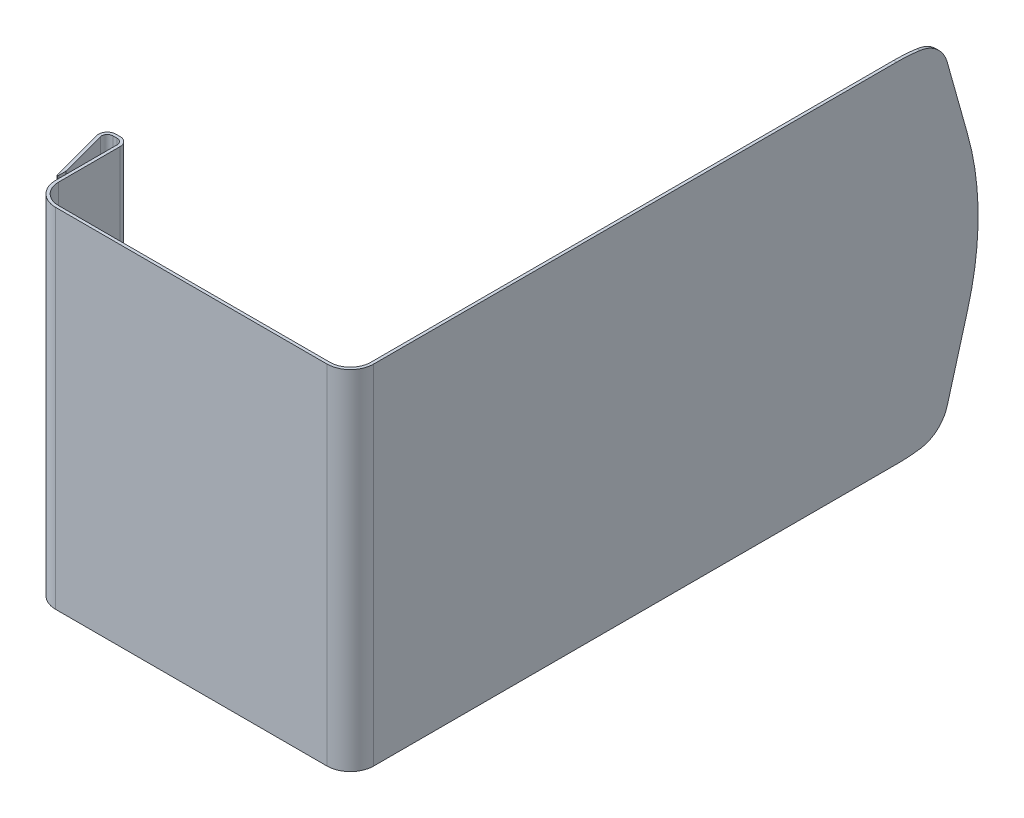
ISO-10303-21;
HEADER;
FILE_DESCRIPTION(('STEP AP214'),'2;1');
FILE_NAME('part.step','',(''),(''),'','','');
FILE_SCHEMA(('AUTOMOTIVE_DESIGN { 1 0 10303 214 1 1 1 1 }'));
ENDSEC;
DATA;
#1=APPLICATION_CONTEXT('core data for automotive mechanical design processes');
#2=APPLICATION_PROTOCOL_DEFINITION('international standard','automotive_design',2000,#1);
#3=PRODUCT_CONTEXT('',#1,'mechanical');
#4=PRODUCT('Part','Part','',(#3));
#5=PRODUCT_RELATED_PRODUCT_CATEGORY('part','',(#4));
#6=PRODUCT_DEFINITION_FORMATION('','',#4);
#7=PRODUCT_DEFINITION_CONTEXT('part definition',#1,'design');
#8=PRODUCT_DEFINITION('design','',#6,#7);
#9=PRODUCT_DEFINITION_SHAPE('','',#8);
#10=(LENGTH_UNIT() NAMED_UNIT(*) SI_UNIT(.MILLI.,.METRE.));
#11=(NAMED_UNIT(*) PLANE_ANGLE_UNIT() SI_UNIT($,.RADIAN.));
#12=(NAMED_UNIT(*) SI_UNIT($,.STERADIAN.) SOLID_ANGLE_UNIT());
#13=UNCERTAINTY_MEASURE_WITH_UNIT(LENGTH_MEASURE(1.E-05),#10,'distance_accuracy_value','');
#14=(GEOMETRIC_REPRESENTATION_CONTEXT(3) GLOBAL_UNCERTAINTY_ASSIGNED_CONTEXT((#13)) GLOBAL_UNIT_ASSIGNED_CONTEXT((#10,
#11,#12)) REPRESENTATION_CONTEXT('',''));
#15=CARTESIAN_POINT('',(0.,0.,0.));
#16=DIRECTION('',(0.,0.,1.));
#17=DIRECTION('',(1.,0.,0.));
#18=AXIS2_PLACEMENT_3D('',#15,#16,#17);
#19=CARTESIAN_POINT('',(3.175,186.063255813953,277.));
#20=DIRECTION('',(0.,-1.,0.));
#21=DIRECTION('',(0.,0.,-1.));
#22=AXIS2_PLACEMENT_3D('',#19,#20,#21);
#23=PLANE('',#22);
#24=DIRECTION('',(0.,0.,1.));
#25=VECTOR('',#24,1.);
#26=CARTESIAN_POINT('',(0.,186.063255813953,277.));
#27=LINE('',#26,#25);
#28=CARTESIAN_POINT('',(0.,186.063255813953,-277.));
#29=VERTEX_POINT('',#28);
#30=CARTESIAN_POINT('',(0.,186.063255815,282.));
#31=VERTEX_POINT('',#30);
#32=EDGE_CURVE('E868',#29,#31,#27,.T.);
#33=ORIENTED_EDGE('',*,*,#32,.T.);
#34=CARTESIAN_POINT('',(-21.825,186.063255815,282.));
#35=DIRECTION('',(0.,-1.,0.));
#36=DIRECTION('',(0.,0.,-1.));
#37=AXIS2_PLACEMENT_3D('',#34,#35,#36);
#38=CIRCLE('',#37,21.825);
#39=CARTESIAN_POINT('',(-21.825,186.063255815,303.825));
#40=VERTEX_POINT('',#39);
#41=EDGE_CURVE('E664',#31,#40,#38,.T.);
#42=ORIENTED_EDGE('',*,*,#41,.T.);
#43=DIRECTION('',(-1.,0.,0.));
#44=VECTOR('',#43,1.);
#45=CARTESIAN_POINT('',(-21.825,186.063255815,303.825));
#46=LINE('',#45,#44);
#47=CARTESIAN_POINT('',(-311.825,186.063255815,303.825));
#48=VERTEX_POINT('',#47);
#49=EDGE_CURVE('E666',#40,#48,#46,.T.);
#50=ORIENTED_EDGE('',*,*,#49,.T.);
#51=CARTESIAN_POINT('',(-311.825,186.063255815,282.));
#52=DIRECTION('',(0.,-1.,0.));
#53=DIRECTION('',(0.,0.,-1.));
#54=AXIS2_PLACEMENT_3D('',#51,#52,#53);
#55=CIRCLE('',#54,21.825);
#56=CARTESIAN_POINT('',(-333.65,186.063255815,282.));
#57=VERTEX_POINT('',#56);
#58=EDGE_CURVE('E671',#48,#57,#55,.T.);
#59=ORIENTED_EDGE('',*,*,#58,.T.);
#60=DIRECTION('',(0.,0.,-1.));
#61=VECTOR('',#60,1.);
#62=CARTESIAN_POINT('',(-333.65,186.063255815,282.));
#63=LINE('',#62,#61);
#64=CARTESIAN_POINT('',(-333.65,186.063255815,216.175));
#65=VERTEX_POINT('',#64);
#66=EDGE_CURVE('E673',#57,#65,#63,.T.);
#67=ORIENTED_EDGE('',*,*,#66,.T.);
#68=CARTESIAN_POINT('',(-342.825,186.063255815,216.175));
#69=DIRECTION('',(0.,1.,0.));
#70=DIRECTION('',(0.,0.,1.));
#71=AXIS2_PLACEMENT_3D('',#68,#69,#70);
#72=CIRCLE('',#71,9.175);
#73=CARTESIAN_POINT('',(-342.825,186.063255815,207.));
#74=VERTEX_POINT('',#73);
#75=EDGE_CURVE('E680',#65,#74,#72,.T.);
#76=ORIENTED_EDGE('',*,*,#75,.T.);
#77=DIRECTION('',(-1.,0.,0.));
#78=VECTOR('',#77,1.);
#79=CARTESIAN_POINT('',(-342.825,186.063255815,207.));
#80=LINE('',#79,#78);
#81=CARTESIAN_POINT('',(-347.457699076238,186.063255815,207.));
#82=VERTEX_POINT('',#81);
#83=EDGE_CURVE('E678',#74,#82,#80,.T.);
#84=ORIENTED_EDGE('',*,*,#83,.T.);
#85=CARTESIAN_POINT('',(-347.457699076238,186.063255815,216.175));
#86=DIRECTION('',(0.,1.,0.));
#87=DIRECTION('',(0.,0.,1.));
#88=AXIS2_PLACEMENT_3D('',#85,#86,#87);
#89=CIRCLE('',#88,9.17500000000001);
#90=CARTESIAN_POINT('',(-356.32006853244,186.063255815,218.549664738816));
#91=VERTEX_POINT('',#90);
#92=EDGE_CURVE('E681',#82,#91,#89,.T.);
#93=ORIENTED_EDGE('',*,*,#92,.T.);
#94=DIRECTION('',(0.258819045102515,0.,0.96592582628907));
#95=VECTOR('',#94,1.);
#96=CARTESIAN_POINT('',(-356.32006853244,186.063255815,218.549664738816));
#97=LINE('',#96,#95);
#98=CARTESIAN_POINT('',(-340.790925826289,186.063255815,276.50521431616));
#99=VERTEX_POINT('',#98);
#100=EDGE_CURVE('E688',#91,#99,#97,.T.);
#101=ORIENTED_EDGE('',*,*,#100,.T.);
#102=DIRECTION('',(0.965925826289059,0.,-0.258819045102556));
#103=VECTOR('',#102,1.);
#104=CARTESIAN_POINT('',(-340.566180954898,186.063255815,276.444994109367));
#105=LINE('',#104,#103);
#106=CARTESIAN_POINT('',(-340.566180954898,186.063255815,276.444994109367));
#107=VERTEX_POINT('',#106);
#108=EDGE_CURVE('E689',#99,#107,#105,.T.);
#109=ORIENTED_EDGE('',*,*,#108,.T.);
#110=CARTESIAN_POINT('',(-340.825,186.063255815,275.479068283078));
#111=DIRECTION('',(0.,1.,0.));
#112=DIRECTION('',(0.,0.,-1.));
#113=AXIS2_PLACEMENT_3D('',#110,#111,#112);
#114=CIRCLE('',#113,0.999999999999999);
#115=CARTESIAN_POINT('',(-339.825,186.063255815,275.479068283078));
#116=VERTEX_POINT('',#115);
#117=EDGE_CURVE('E695',#107,#116,#114,.T.);
#118=ORIENTED_EDGE('',*,*,#117,.T.);
#119=DIRECTION('',(0.,0.,-1.));
#120=VECTOR('',#119,1.);
#121=CARTESIAN_POINT('',(-339.825,186.063255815,275.479068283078));
#122=LINE('',#121,#120);
#123=CARTESIAN_POINT('',(-339.825,186.063255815,267.974493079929));
#124=VERTEX_POINT('',#123);
#125=EDGE_CURVE('E694',#116,#124,#122,.T.);
#126=ORIENTED_EDGE('',*,*,#125,.T.);
#127=CARTESIAN_POINT('',(-340.825,186.063255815,267.974493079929));
#128=DIRECTION('',(0.,1.,0.));
#129=DIRECTION('',(0.,0.,-1.));
#130=AXIS2_PLACEMENT_3D('',#127,#128,#129);
#131=CIRCLE('',#130,0.999999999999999);
#132=CARTESIAN_POINT('',(-339.859074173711,186.063255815,267.715674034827));
#133=VERTEX_POINT('',#132);
#134=EDGE_CURVE('E698',#124,#133,#131,.T.);
#135=ORIENTED_EDGE('',*,*,#134,.T.);
#136=DIRECTION('',(-0.258819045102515,0.,-0.96592582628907));
#137=VECTOR('',#136,1.);
#138=CARTESIAN_POINT('',(-353.253254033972,186.063255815,217.727914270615));
#139=LINE('',#138,#137);
#140=CARTESIAN_POINT('',(-353.253254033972,186.063255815,217.727914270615));
#141=VERTEX_POINT('',#140);
#142=EDGE_CURVE('E701',#133,#141,#139,.T.);
#143=ORIENTED_EDGE('',*,*,#142,.T.);
#144=CARTESIAN_POINT('',(-347.457699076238,186.063255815,216.175));
#145=DIRECTION('',(0.,-1.,0.));
#146=DIRECTION('',(0.,0.,1.));
#147=AXIS2_PLACEMENT_3D('',#144,#145,#146);
#148=CIRCLE('',#147,5.99999999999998);
#149=CARTESIAN_POINT('',(-347.457699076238,186.063255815,210.175));
#150=VERTEX_POINT('',#149);
#151=EDGE_CURVE('E703',#141,#150,#148,.T.);
#152=ORIENTED_EDGE('',*,*,#151,.T.);
#153=DIRECTION('',(1.,0.,0.));
#154=VECTOR('',#153,1.);
#155=CARTESIAN_POINT('',(-342.825,186.063255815,210.175));
#156=LINE('',#155,#154);
#157=CARTESIAN_POINT('',(-342.825,186.063255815,210.175));
#158=VERTEX_POINT('',#157);
#159=EDGE_CURVE('E710',#150,#158,#156,.T.);
#160=ORIENTED_EDGE('',*,*,#159,.T.);
#161=CARTESIAN_POINT('',(-342.825,186.063255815,216.175));
#162=DIRECTION('',(0.,-1.,0.));
#163=DIRECTION('',(0.,0.,1.));
#164=AXIS2_PLACEMENT_3D('',#161,#162,#163);
#165=CIRCLE('',#164,6.00000000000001);
#166=CARTESIAN_POINT('',(-336.825,186.063255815,216.175));
#167=VERTEX_POINT('',#166);
#168=EDGE_CURVE('E708',#158,#167,#165,.T.);
#169=ORIENTED_EDGE('',*,*,#168,.T.);
#170=DIRECTION('',(0.,0.,1.));
#171=VECTOR('',#170,1.);
#172=CARTESIAN_POINT('',(-336.825,186.063255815,282.));
#173=LINE('',#172,#171);
#174=CARTESIAN_POINT('',(-336.825,186.063255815,282.));
#175=VERTEX_POINT('',#174);
#176=EDGE_CURVE('E715',#167,#175,#173,.T.);
#177=ORIENTED_EDGE('',*,*,#176,.T.);
#178=CARTESIAN_POINT('',(-311.825,186.063255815,282.));
#179=DIRECTION('',(0.,1.,0.));
#180=DIRECTION('',(0.,0.,-1.));
#181=AXIS2_PLACEMENT_3D('',#178,#179,#180);
#182=CIRCLE('',#181,25.);
#183=CARTESIAN_POINT('',(-311.825,186.063255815,307.));
#184=VERTEX_POINT('',#183);
#185=EDGE_CURVE('E716',#175,#184,#182,.T.);
#186=ORIENTED_EDGE('',*,*,#185,.T.);
#187=DIRECTION('',(1.,0.,0.));
#188=VECTOR('',#187,1.);
#189=CARTESIAN_POINT('',(-21.825,186.063255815,307.));
#190=LINE('',#189,#188);
#191=CARTESIAN_POINT('',(-21.825,186.063255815,307.));
#192=VERTEX_POINT('',#191);
#193=EDGE_CURVE('E718',#184,#192,#190,.T.);
#194=ORIENTED_EDGE('',*,*,#193,.T.);
#195=CARTESIAN_POINT('',(-21.825,186.063255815,282.));
#196=DIRECTION('',(0.,1.,0.));
#197=DIRECTION('',(0.,0.,-1.));
#198=AXIS2_PLACEMENT_3D('',#195,#196,#197);
#199=CIRCLE('',#198,25.);
#200=CARTESIAN_POINT('',(3.175,186.063255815,282.));
#201=VERTEX_POINT('',#200);
#202=EDGE_CURVE('E725',#192,#201,#199,.T.);
#203=ORIENTED_EDGE('',*,*,#202,.T.);
#204=DIRECTION('',(0.,0.,1.));
#205=VECTOR('',#204,1.);
#206=CARTESIAN_POINT('',(3.175,186.063255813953,277.));
#207=LINE('',#206,#205);
#208=CARTESIAN_POINT('',(3.175,186.063255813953,-277.));
#209=VERTEX_POINT('',#208);
#210=EDGE_CURVE('E437',#209,#201,#207,.T.);
#211=ORIENTED_EDGE('',*,*,#210,.F.);
#212=DIRECTION('',(-1.,0.,0.));
#213=VECTOR('',#212,1.);
#214=CARTESIAN_POINT('',(3.175,186.063255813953,-277.));
#215=LINE('',#214,#213);
#216=EDGE_CURVE('E435',#209,#29,#215,.T.);
#217=ORIENTED_EDGE('',*,*,#216,.T.);
#218=EDGE_LOOP('',(#33,#42,#50,#59,#67,#76,#84,#93,#101,#109,#118,#126,#135,#143,#152,#160,#169,
#177,#186,#194,#203,#211,#217));
#219=FACE_BOUND('',#218,.T.);
#220=ADVANCED_FACE('F421',(#219),#23,.F.);
#221=CARTESIAN_POINT('',(3.175,-186.063255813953,277.));
#222=DIRECTION('',(0.,1.,0.));
#223=DIRECTION('',(0.,0.,1.));
#224=AXIS2_PLACEMENT_3D('',#221,#222,#223);
#225=PLANE('',#224);
#226=DIRECTION('',(0.,0.,-1.));
#227=VECTOR('',#226,1.);
#228=CARTESIAN_POINT('',(0.,-186.063255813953,277.));
#229=LINE('',#228,#227);
#230=CARTESIAN_POINT('',(0.,-186.063255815,282.));
#231=VERTEX_POINT('',#230);
#232=CARTESIAN_POINT('',(0.,-186.063255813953,-277.));
#233=VERTEX_POINT('',#232);
#234=EDGE_CURVE('E875',#231,#233,#229,.T.);
#235=ORIENTED_EDGE('',*,*,#234,.T.);
#236=DIRECTION('',(-1.,0.,0.));
#237=VECTOR('',#236,1.);
#238=CARTESIAN_POINT('',(3.175,-186.063255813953,-277.));
#239=LINE('',#238,#237);
#240=CARTESIAN_POINT('',(3.175,-186.063255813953,-277.));
#241=VERTEX_POINT('',#240);
#242=EDGE_CURVE('E12',#241,#233,#239,.T.);
#243=ORIENTED_EDGE('',*,*,#242,.F.);
#244=DIRECTION('',(0.,0.,-1.));
#245=VECTOR('',#244,1.);
#246=CARTESIAN_POINT('',(3.175,-186.063255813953,277.));
#247=LINE('',#246,#245);
#248=CARTESIAN_POINT('',(3.175,-186.063255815,282.));
#249=VERTEX_POINT('',#248);
#250=EDGE_CURVE('E634',#249,#241,#247,.T.);
#251=ORIENTED_EDGE('',*,*,#250,.F.);
#252=CARTESIAN_POINT('',(-21.825,-186.063255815,282.));
#253=DIRECTION('',(0.,1.,0.));
#254=DIRECTION('',(0.,0.,-1.));
#255=AXIS2_PLACEMENT_3D('',#252,#253,#254);
#256=CIRCLE('',#255,25.);
#257=CARTESIAN_POINT('',(-21.825,-186.063255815,307.));
#258=VERTEX_POINT('',#257);
#259=EDGE_CURVE('E670',#258,#249,#256,.T.);
#260=ORIENTED_EDGE('',*,*,#259,.F.);
#261=DIRECTION('',(1.,0.,0.));
#262=VECTOR('',#261,1.);
#263=CARTESIAN_POINT('',(-21.825,-186.063255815,307.));
#264=LINE('',#263,#262);
#265=CARTESIAN_POINT('',(-311.825,-186.063255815,307.));
#266=VERTEX_POINT('',#265);
#267=EDGE_CURVE('E781',#266,#258,#264,.T.);
#268=ORIENTED_EDGE('',*,*,#267,.F.);
#269=CARTESIAN_POINT('',(-311.825,-186.063255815,282.));
#270=DIRECTION('',(0.,1.,0.));
#271=DIRECTION('',(0.,0.,-1.));
#272=AXIS2_PLACEMENT_3D('',#269,#270,#271);
#273=CIRCLE('',#272,25.);
#274=CARTESIAN_POINT('',(-336.825,-186.063255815,282.));
#275=VERTEX_POINT('',#274);
#276=EDGE_CURVE('E780',#275,#266,#273,.T.);
#277=ORIENTED_EDGE('',*,*,#276,.F.);
#278=DIRECTION('',(0.,0.,1.));
#279=VECTOR('',#278,1.);
#280=CARTESIAN_POINT('',(-336.825,-186.063255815,282.));
#281=LINE('',#280,#279);
#282=CARTESIAN_POINT('',(-336.825,-186.063255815,216.175));
#283=VERTEX_POINT('',#282);
#284=EDGE_CURVE('E773',#283,#275,#281,.T.);
#285=ORIENTED_EDGE('',*,*,#284,.F.);
#286=CARTESIAN_POINT('',(-342.825,-186.063255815,216.175));
#287=DIRECTION('',(0.,-1.,0.));
#288=DIRECTION('',(0.,0.,1.));
#289=AXIS2_PLACEMENT_3D('',#286,#287,#288);
#290=CIRCLE('',#289,6.00000000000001);
#291=CARTESIAN_POINT('',(-342.825,-186.063255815,210.175));
#292=VERTEX_POINT('',#291);
#293=EDGE_CURVE('E775',#292,#283,#290,.T.);
#294=ORIENTED_EDGE('',*,*,#293,.F.);
#295=DIRECTION('',(1.,0.,0.));
#296=VECTOR('',#295,1.);
#297=CARTESIAN_POINT('',(-342.825,-186.063255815,210.175));
#298=LINE('',#297,#296);
#299=CARTESIAN_POINT('',(-347.457699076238,-186.063255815,210.175));
#300=VERTEX_POINT('',#299);
#301=EDGE_CURVE('E768',#300,#292,#298,.T.);
#302=ORIENTED_EDGE('',*,*,#301,.F.);
#303=CARTESIAN_POINT('',(-347.457699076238,-186.063255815,216.175));
#304=DIRECTION('',(0.,-1.,0.));
#305=DIRECTION('',(0.,0.,1.));
#306=AXIS2_PLACEMENT_3D('',#303,#304,#305);
#307=CIRCLE('',#306,5.99999999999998);
#308=CARTESIAN_POINT('',(-353.253254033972,-186.063255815,217.727914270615));
#309=VERTEX_POINT('',#308);
#310=EDGE_CURVE('E766',#309,#300,#307,.T.);
#311=ORIENTED_EDGE('',*,*,#310,.F.);
#312=DIRECTION('',(-0.258819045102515,0.,-0.96592582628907));
#313=VECTOR('',#312,1.);
#314=CARTESIAN_POINT('',(-353.253254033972,-186.063255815,217.727914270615));
#315=LINE('',#314,#313);
#316=CARTESIAN_POINT('',(-339.859074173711,-186.063255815,267.715674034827));
#317=VERTEX_POINT('',#316);
#318=EDGE_CURVE('E763',#317,#309,#315,.T.);
#319=ORIENTED_EDGE('',*,*,#318,.F.);
#320=CARTESIAN_POINT('',(-340.825,-186.063255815,267.974493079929));
#321=DIRECTION('',(0.,1.,0.));
#322=DIRECTION('',(0.,0.,-1.));
#323=AXIS2_PLACEMENT_3D('',#320,#321,#322);
#324=CIRCLE('',#323,0.999999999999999);
#325=CARTESIAN_POINT('',(-339.825,-186.063255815,267.974493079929));
#326=VERTEX_POINT('',#325);
#327=EDGE_CURVE('E759',#326,#317,#324,.T.);
#328=ORIENTED_EDGE('',*,*,#327,.F.);
#329=DIRECTION('',(0.,0.,-1.));
#330=VECTOR('',#329,1.);
#331=CARTESIAN_POINT('',(-339.825,-186.063255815,275.479068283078));
#332=LINE('',#331,#330);
#333=CARTESIAN_POINT('',(-339.825,-186.063255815,275.479068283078));
#334=VERTEX_POINT('',#333);
#335=EDGE_CURVE('E760',#334,#326,#332,.T.);
#336=ORIENTED_EDGE('',*,*,#335,.F.);
#337=CARTESIAN_POINT('',(-340.825,-186.063255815,275.479068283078));
#338=DIRECTION('',(0.,1.,0.));
#339=DIRECTION('',(0.,0.,-1.));
#340=AXIS2_PLACEMENT_3D('',#337,#338,#339);
#341=CIRCLE('',#340,0.999999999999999);
#342=CARTESIAN_POINT('',(-340.566180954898,-186.063255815,276.444994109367));
#343=VERTEX_POINT('',#342);
#344=EDGE_CURVE('E754',#343,#334,#341,.T.);
#345=ORIENTED_EDGE('',*,*,#344,.F.);
#346=DIRECTION('',(0.965925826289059,0.,-0.258819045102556));
#347=VECTOR('',#346,1.);
#348=CARTESIAN_POINT('',(-340.566180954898,-186.063255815,276.444994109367));
#349=LINE('',#348,#347);
#350=CARTESIAN_POINT('',(-340.790925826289,-186.063255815,276.50521431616));
#351=VERTEX_POINT('',#350);
#352=EDGE_CURVE('E753',#351,#343,#349,.T.);
#353=ORIENTED_EDGE('',*,*,#352,.F.);
#354=DIRECTION('',(0.258819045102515,0.,0.96592582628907));
#355=VECTOR('',#354,1.);
#356=CARTESIAN_POINT('',(-356.32006853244,-186.063255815,218.549664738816));
#357=LINE('',#356,#355);
#358=CARTESIAN_POINT('',(-356.32006853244,-186.063255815,218.549664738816));
#359=VERTEX_POINT('',#358);
#360=EDGE_CURVE('E746',#359,#351,#357,.T.);
#361=ORIENTED_EDGE('',*,*,#360,.F.);
#362=CARTESIAN_POINT('',(-347.457699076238,-186.063255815,216.175));
#363=DIRECTION('',(0.,1.,0.));
#364=DIRECTION('',(0.,0.,1.));
#365=AXIS2_PLACEMENT_3D('',#362,#363,#364);
#366=CIRCLE('',#365,9.17500000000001);
#367=CARTESIAN_POINT('',(-347.457699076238,-186.063255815,207.));
#368=VERTEX_POINT('',#367);
#369=EDGE_CURVE('E743',#368,#359,#366,.T.);
#370=ORIENTED_EDGE('',*,*,#369,.F.);
#371=DIRECTION('',(-1.,0.,0.));
#372=VECTOR('',#371,1.);
#373=CARTESIAN_POINT('',(-342.825,-186.063255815,207.));
#374=LINE('',#373,#372);
#375=CARTESIAN_POINT('',(-342.825,-186.063255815,207.));
#376=VERTEX_POINT('',#375);
#377=EDGE_CURVE('E745',#376,#368,#374,.T.);
#378=ORIENTED_EDGE('',*,*,#377,.F.);
#379=CARTESIAN_POINT('',(-342.825,-186.063255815,216.175));
#380=DIRECTION('',(0.,1.,0.));
#381=DIRECTION('',(0.,0.,1.));
#382=AXIS2_PLACEMENT_3D('',#379,#380,#381);
#383=CIRCLE('',#382,9.175);
#384=CARTESIAN_POINT('',(-333.65,-186.063255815,216.175));
#385=VERTEX_POINT('',#384);
#386=EDGE_CURVE('E738',#385,#376,#383,.T.);
#387=ORIENTED_EDGE('',*,*,#386,.F.);
#388=DIRECTION('',(0.,0.,-1.));
#389=VECTOR('',#388,1.);
#390=CARTESIAN_POINT('',(-333.65,-186.063255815,282.));
#391=LINE('',#390,#389);
#392=CARTESIAN_POINT('',(-333.65,-186.063255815,282.));
#393=VERTEX_POINT('',#392);
#394=EDGE_CURVE('E736',#393,#385,#391,.T.);
#395=ORIENTED_EDGE('',*,*,#394,.F.);
#396=CARTESIAN_POINT('',(-311.825,-186.063255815,282.));
#397=DIRECTION('',(0.,-1.,0.));
#398=DIRECTION('',(0.,0.,-1.));
#399=AXIS2_PLACEMENT_3D('',#396,#397,#398);
#400=CIRCLE('',#399,21.825);
#401=CARTESIAN_POINT('',(-311.825,-186.063255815,303.825));
#402=VERTEX_POINT('',#401);
#403=EDGE_CURVE('E735',#402,#393,#400,.T.);
#404=ORIENTED_EDGE('',*,*,#403,.F.);
#405=DIRECTION('',(-1.,0.,0.));
#406=VECTOR('',#405,1.);
#407=CARTESIAN_POINT('',(-21.825,-186.063255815,303.825));
#408=LINE('',#407,#406);
#409=CARTESIAN_POINT('',(-21.825,-186.063255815,303.825));
#410=VERTEX_POINT('',#409);
#411=EDGE_CURVE('E729',#410,#402,#408,.T.);
#412=ORIENTED_EDGE('',*,*,#411,.F.);
#413=CARTESIAN_POINT('',(-21.825,-186.063255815,282.));
#414=DIRECTION('',(0.,-1.,0.));
#415=DIRECTION('',(0.,0.,-1.));
#416=AXIS2_PLACEMENT_3D('',#413,#414,#415);
#417=CIRCLE('',#416,21.825);
#418=EDGE_CURVE('E727',#231,#410,#417,.T.);
#419=ORIENTED_EDGE('',*,*,#418,.F.);
#420=EDGE_LOOP('',(#235,#243,#251,#260,#268,#277,#285,#294,#302,#311,#319,#328,#336,#345,#353,
#361,#370,#378,#387,#395,#404,#412,#419));
#421=FACE_BOUND('',#420,.T.);
#422=ADVANCED_FACE('F950',(#421),#225,.F.);
#423=CARTESIAN_POINT('',(3.175,0.,0.));
#424=DIRECTION('',(1.,0.,0.));
#425=DIRECTION('',(0.,0.,-1.));
#426=AXIS2_PLACEMENT_3D('',#423,#424,#425);
#427=PLANE('',#426);
#428=ORIENTED_EDGE('',*,*,#210,.T.);
#429=DIRECTION('',(0.,-1.,0.));
#430=VECTOR('',#429,1.);
#431=CARTESIAN_POINT('',(3.175,186.063255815,282.));
#432=LINE('',#431,#430);
#433=EDGE_CURVE('E723',#201,#249,#432,.T.);
#434=ORIENTED_EDGE('',*,*,#433,.T.);
#435=ORIENTED_EDGE('',*,*,#250,.T.);
#436=CARTESIAN_POINT('',(3.17499999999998,0.,-277.));
#437=DIRECTION('',(1.,0.,0.));
#438=DIRECTION('',(0.,0.,-1.));
#439=AXIS2_PLACEMENT_3D('',#436,#437,#438);
#440=CIRCLE('',#439,186.063255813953);
#441=CARTESIAN_POINT('',(3.17499999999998,-184.388589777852,-301.907491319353));
#442=VERTEX_POINT('',#441);
#443=EDGE_CURVE('E625',#241,#442,#440,.T.);
#444=ORIENTED_EDGE('',*,*,#443,.T.);
#445=CARTESIAN_POINT('',(3.17499999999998,-149.703607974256,-297.222191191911));
#446=DIRECTION('',(1.,0.,0.));
#447=DIRECTION('',(0.,0.,-1.));
#448=AXIS2_PLACEMENT_3D('',#445,#446,#447);
#449=CIRCLE('',#448,35.);
#450=CARTESIAN_POINT('',(3.17499999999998,-159.149882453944,-330.923346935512));
#451=VERTEX_POINT('',#450);
#452=EDGE_CURVE('E610',#442,#451,#449,.T.);
#453=ORIENTED_EDGE('',*,*,#452,.T.);
#454=DIRECTION('',(0.,0.962890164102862,-0.269893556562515));
#455=VECTOR('',#454,1.);
#456=CARTESIAN_POINT('',(3.17499999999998,-159.149882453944,-330.923346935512));
#457=LINE('',#456,#455);
#458=CARTESIAN_POINT('',(3.17499999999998,-80.9680669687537,-352.837339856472));
#459=VERTEX_POINT('',#458);
#460=EDGE_CURVE('E623',#451,#459,#457,.T.);
#461=ORIENTED_EDGE('',*,*,#460,.T.);
#462=CARTESIAN_POINT('',(3.17499999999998,7.93635990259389E-13,-63.9702906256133));
#463=DIRECTION('',(1.,0.,0.));
#464=DIRECTION('',(0.,0.,-1.));
#465=AXIS2_PLACEMENT_3D('',#462,#463,#464);
#466=CIRCLE('',#465,300.);
#467=CARTESIAN_POINT('',(3.17499999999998,80.9680669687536,-352.837339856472));
#468=VERTEX_POINT('',#467);
#469=EDGE_CURVE('E921',#459,#468,#466,.T.);
#470=ORIENTED_EDGE('',*,*,#469,.T.);
#471=DIRECTION('',(0.,0.962890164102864,0.26989355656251));
#472=VECTOR('',#471,1.);
#473=CARTESIAN_POINT('',(3.17499999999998,80.9680669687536,-352.837339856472));
#474=LINE('',#473,#472);
#475=CARTESIAN_POINT('',(3.17499999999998,159.149882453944,-330.923346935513));
#476=VERTEX_POINT('',#475);
#477=EDGE_CURVE('E916',#468,#476,#474,.T.);
#478=ORIENTED_EDGE('',*,*,#477,.T.);
#479=CARTESIAN_POINT('',(3.17499999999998,149.703607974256,-297.222191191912));
#480=DIRECTION('',(1.,0.,0.));
#481=DIRECTION('',(0.,0.,-1.));
#482=AXIS2_PLACEMENT_3D('',#479,#480,#481);
#483=CIRCLE('',#482,35.);
#484=CARTESIAN_POINT('',(3.17499999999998,184.388589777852,-301.907491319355));
#485=VERTEX_POINT('',#484);
#486=EDGE_CURVE('E917',#476,#485,#483,.T.);
#487=ORIENTED_EDGE('',*,*,#486,.T.);
#488=CARTESIAN_POINT('',(3.17499999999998,0.,-277.));
#489=DIRECTION('',(1.,0.,0.));
#490=DIRECTION('',(0.,0.,-1.));
#491=AXIS2_PLACEMENT_3D('',#488,#489,#490);
#492=CIRCLE('',#491,186.063255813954);
#493=EDGE_CURVE('E728',#485,#209,#492,.T.);
#494=ORIENTED_EDGE('',*,*,#493,.T.);
#495=EDGE_LOOP('',(#428,#434,#435,#444,#453,#461,#470,#478,#487,#494));
#496=FACE_BOUND('',#495,.T.);
#497=ADVANCED_FACE('F633',(#496),#427,.T.);
#498=CARTESIAN_POINT('',(0.,0.,0.));
#499=DIRECTION('',(1.,0.,0.));
#500=DIRECTION('',(0.,0.,-1.));
#501=AXIS2_PLACEMENT_3D('',#498,#499,#500);
#502=PLANE('',#501);
#503=ORIENTED_EDGE('',*,*,#32,.F.);
#504=CARTESIAN_POINT('',(0.,0.,-277.));
#505=DIRECTION('',(1.,0.,0.));
#506=DIRECTION('',(0.,0.,-1.));
#507=AXIS2_PLACEMENT_3D('',#504,#505,#506);
#508=CIRCLE('',#507,186.063255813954);
#509=CARTESIAN_POINT('',(0.,184.388589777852,-301.907491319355));
#510=VERTEX_POINT('',#509);
#511=EDGE_CURVE('E637',#510,#29,#508,.T.);
#512=ORIENTED_EDGE('',*,*,#511,.F.);
#513=CARTESIAN_POINT('',(0.,149.703607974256,-297.222191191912));
#514=DIRECTION('',(1.,0.,0.));
#515=DIRECTION('',(0.,0.,1.));
#516=AXIS2_PLACEMENT_3D('',#513,#514,#515);
#517=CIRCLE('',#516,35.);
#518=CARTESIAN_POINT('',(0.,159.149882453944,-330.923346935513));
#519=VERTEX_POINT('',#518);
#520=EDGE_CURVE('E662',#519,#510,#517,.T.);
#521=ORIENTED_EDGE('',*,*,#520,.F.);
#522=DIRECTION('',(0.,0.962890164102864,0.26989355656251));
#523=VECTOR('',#522,1.);
#524=CARTESIAN_POINT('',(0.,80.9680669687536,-352.837339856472));
#525=LINE('',#524,#523);
#526=CARTESIAN_POINT('',(0.,80.9680669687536,-352.837339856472));
#527=VERTEX_POINT('',#526);
#528=EDGE_CURVE('E660',#527,#519,#525,.T.);
#529=ORIENTED_EDGE('',*,*,#528,.F.);
#530=CARTESIAN_POINT('',(0.,7.93635990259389E-13,-63.9702906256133));
#531=DIRECTION('',(1.,0.,0.));
#532=DIRECTION('',(0.,0.,-1.));
#533=AXIS2_PLACEMENT_3D('',#530,#531,#532);
#534=CIRCLE('',#533,300.);
#535=CARTESIAN_POINT('',(0.,-80.9680669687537,-352.837339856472));
#536=VERTEX_POINT('',#535);
#537=EDGE_CURVE('E654',#536,#527,#534,.T.);
#538=ORIENTED_EDGE('',*,*,#537,.F.);
#539=DIRECTION('',(0.,0.962890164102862,-0.269893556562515));
#540=VECTOR('',#539,1.);
#541=CARTESIAN_POINT('',(0.,-159.149882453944,-330.923346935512));
#542=LINE('',#541,#540);
#543=CARTESIAN_POINT('',(0.,-159.149882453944,-330.923346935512));
#544=VERTEX_POINT('',#543);
#545=EDGE_CURVE('E648',#544,#536,#542,.T.);
#546=ORIENTED_EDGE('',*,*,#545,.F.);
#547=CARTESIAN_POINT('',(0.,-149.703607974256,-297.222191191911));
#548=DIRECTION('',(1.,0.,0.));
#549=DIRECTION('',(0.,0.,1.));
#550=AXIS2_PLACEMENT_3D('',#547,#548,#549);
#551=CIRCLE('',#550,35.);
#552=CARTESIAN_POINT('',(0.,-184.388589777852,-301.907491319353));
#553=VERTEX_POINT('',#552);
#554=EDGE_CURVE('E631',#553,#544,#551,.T.);
#555=ORIENTED_EDGE('',*,*,#554,.F.);
#556=CARTESIAN_POINT('',(0.,0.,-277.));
#557=DIRECTION('',(1.,0.,0.));
#558=DIRECTION('',(0.,0.,-1.));
#559=AXIS2_PLACEMENT_3D('',#556,#557,#558);
#560=CIRCLE('',#559,186.063255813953);
#561=EDGE_CURVE('E627',#233,#553,#560,.T.);
#562=ORIENTED_EDGE('',*,*,#561,.F.);
#563=ORIENTED_EDGE('',*,*,#234,.F.);
#564=DIRECTION('',(0.,-1.,0.));
#565=VECTOR('',#564,1.);
#566=CARTESIAN_POINT('',(0.,186.063255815,282.));
#567=LINE('',#566,#565);
#568=EDGE_CURVE('E862',#31,#231,#567,.T.);
#569=ORIENTED_EDGE('',*,*,#568,.F.);
#570=EDGE_LOOP('',(#503,#512,#521,#529,#538,#546,#555,#562,#563,#569));
#571=FACE_BOUND('',#570,.T.);
#572=ADVANCED_FACE('F886',(#571),#502,.F.);
#573=CARTESIAN_POINT('',(-21.825,186.063255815,282.));
#574=DIRECTION('',(0.,-1.,0.));
#575=DIRECTION('',(0.,0.,-1.));
#576=AXIS2_PLACEMENT_3D('',#573,#574,#575);
#577=CYLINDRICAL_SURFACE('',#576,21.825);
#578=ORIENTED_EDGE('',*,*,#418,.T.);
#579=DIRECTION('',(0.,-1.,0.));
#580=VECTOR('',#579,1.);
#581=CARTESIAN_POINT('',(-21.825,186.063255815,303.825));
#582=LINE('',#581,#580);
#583=EDGE_CURVE('E864',#40,#410,#582,.T.);
#584=ORIENTED_EDGE('',*,*,#583,.F.);
#585=ORIENTED_EDGE('',*,*,#41,.F.);
#586=ORIENTED_EDGE('',*,*,#568,.T.);
#587=EDGE_LOOP('',(#578,#584,#585,#586));
#588=FACE_BOUND('',#587,.T.);
#589=ADVANCED_FACE('F951',(#588),#577,.F.);
#590=CARTESIAN_POINT('',(-21.825,186.063255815,303.825));
#591=DIRECTION('',(0.,0.,1.));
#592=DIRECTION('',(1.,0.,0.));
#593=AXIS2_PLACEMENT_3D('',#590,#591,#592);
#594=PLANE('',#593);
#595=ORIENTED_EDGE('',*,*,#411,.T.);
#596=DIRECTION('',(0.,-1.,0.));
#597=VECTOR('',#596,1.);
#598=CARTESIAN_POINT('',(-311.825,186.063255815,303.825));
#599=LINE('',#598,#597);
#600=EDGE_CURVE('E860',#48,#402,#599,.T.);
#601=ORIENTED_EDGE('',*,*,#600,.F.);
#602=ORIENTED_EDGE('',*,*,#49,.F.);
#603=ORIENTED_EDGE('',*,*,#583,.T.);
#604=EDGE_LOOP('',(#595,#601,#602,#603));
#605=FACE_BOUND('',#604,.T.);
#606=ADVANCED_FACE('F958',(#605),#594,.F.);
#607=CARTESIAN_POINT('',(-311.825,186.063255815,282.));
#608=DIRECTION('',(0.,-1.,0.));
#609=DIRECTION('',(0.,0.,-1.));
#610=AXIS2_PLACEMENT_3D('',#607,#608,#609);
#611=CYLINDRICAL_SURFACE('',#610,21.825);
#612=ORIENTED_EDGE('',*,*,#403,.T.);
#613=DIRECTION('',(0.,-1.,0.));
#614=VECTOR('',#613,1.);
#615=CARTESIAN_POINT('',(-333.65,186.063255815,282.));
#616=LINE('',#615,#614);
#617=EDGE_CURVE('E854',#57,#393,#616,.T.);
#618=ORIENTED_EDGE('',*,*,#617,.F.);
#619=ORIENTED_EDGE('',*,*,#58,.F.);
#620=ORIENTED_EDGE('',*,*,#600,.T.);
#621=EDGE_LOOP('',(#612,#618,#619,#620));
#622=FACE_BOUND('',#621,.T.);
#623=ADVANCED_FACE('F965',(#622),#611,.F.);
#624=CARTESIAN_POINT('',(-333.65,186.063255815,282.));
#625=DIRECTION('',(-1.,0.,0.));
#626=DIRECTION('',(0.,0.,1.));
#627=AXIS2_PLACEMENT_3D('',#624,#625,#626);
#628=PLANE('',#627);
#629=ORIENTED_EDGE('',*,*,#394,.T.);
#630=DIRECTION('',(0.,-1.,0.));
#631=VECTOR('',#630,1.);
#632=CARTESIAN_POINT('',(-333.65,186.063255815,216.175));
#633=LINE('',#632,#631);
#634=EDGE_CURVE('E848',#65,#385,#633,.T.);
#635=ORIENTED_EDGE('',*,*,#634,.F.);
#636=ORIENTED_EDGE('',*,*,#66,.F.);
#637=ORIENTED_EDGE('',*,*,#617,.T.);
#638=EDGE_LOOP('',(#629,#635,#636,#637));
#639=FACE_BOUND('',#638,.T.);
#640=ADVANCED_FACE('F966',(#639),#628,.F.);
#641=CARTESIAN_POINT('',(-342.825,186.063255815,216.175));
#642=DIRECTION('',(0.,-1.,0.));
#643=DIRECTION('',(0.,0.,-1.));
#644=AXIS2_PLACEMENT_3D('',#641,#642,#643);
#645=CYLINDRICAL_SURFACE('',#644,9.175);
#646=ORIENTED_EDGE('',*,*,#386,.T.);
#647=DIRECTION('',(0.,-1.,0.));
#648=VECTOR('',#647,1.);
#649=CARTESIAN_POINT('',(-342.825,186.063255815,207.));
#650=LINE('',#649,#648);
#651=EDGE_CURVE('E842',#74,#376,#650,.T.);
#652=ORIENTED_EDGE('',*,*,#651,.F.);
#653=ORIENTED_EDGE('',*,*,#75,.F.);
#654=ORIENTED_EDGE('',*,*,#634,.T.);
#655=EDGE_LOOP('',(#646,#652,#653,#654));
#656=FACE_BOUND('',#655,.T.);
#657=ADVANCED_FACE('F971',(#656),#645,.T.);
#658=CARTESIAN_POINT('',(-342.825,186.063255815,207.));
#659=DIRECTION('',(0.,0.,1.));
#660=DIRECTION('',(1.,0.,0.));
#661=AXIS2_PLACEMENT_3D('',#658,#659,#660);
#662=PLANE('',#661);
#663=ORIENTED_EDGE('',*,*,#377,.T.);
#664=DIRECTION('',(0.,-1.,0.));
#665=VECTOR('',#664,1.);
#666=CARTESIAN_POINT('',(-347.457699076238,186.063255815,207.));
#667=LINE('',#666,#665);
#668=EDGE_CURVE('E844',#82,#368,#667,.T.);
#669=ORIENTED_EDGE('',*,*,#668,.F.);
#670=ORIENTED_EDGE('',*,*,#83,.F.);
#671=ORIENTED_EDGE('',*,*,#651,.T.);
#672=EDGE_LOOP('',(#663,#669,#670,#671));
#673=FACE_BOUND('',#672,.T.);
#674=ADVANCED_FACE('F977',(#673),#662,.F.);
#675=CARTESIAN_POINT('',(-347.457699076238,186.063255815,216.175));
#676=DIRECTION('',(0.,-1.,0.));
#677=DIRECTION('',(0.,0.,-1.));
#678=AXIS2_PLACEMENT_3D('',#675,#676,#677);
#679=CYLINDRICAL_SURFACE('',#678,9.17500000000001);
#680=ORIENTED_EDGE('',*,*,#369,.T.);
#681=DIRECTION('',(0.,-1.,0.));
#682=VECTOR('',#681,1.);
#683=CARTESIAN_POINT('',(-356.32006853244,186.063255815,218.549664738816));
#684=LINE('',#683,#682);
#685=EDGE_CURVE('E840',#91,#359,#684,.T.);
#686=ORIENTED_EDGE('',*,*,#685,.F.);
#687=ORIENTED_EDGE('',*,*,#92,.F.);
#688=ORIENTED_EDGE('',*,*,#668,.T.);
#689=EDGE_LOOP('',(#680,#686,#687,#688));
#690=FACE_BOUND('',#689,.T.);
#691=ADVANCED_FACE('F984',(#690),#679,.T.);
#692=CARTESIAN_POINT('',(-356.32006853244,186.063255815,218.549664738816));
#693=DIRECTION('',(0.96592582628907,0.,-0.258819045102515));
#694=DIRECTION('',(-0.258819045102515,0.,-0.96592582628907));
#695=AXIS2_PLACEMENT_3D('',#692,#693,#694);
#696=PLANE('',#695);
#697=ORIENTED_EDGE('',*,*,#360,.T.);
#698=DIRECTION('',(0.,-1.,0.));
#699=VECTOR('',#698,1.);
#700=CARTESIAN_POINT('',(-340.790925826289,186.063255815,276.50521431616));
#701=LINE('',#700,#699);
#702=EDGE_CURVE('E832',#99,#351,#701,.T.);
#703=ORIENTED_EDGE('',*,*,#702,.F.);
#704=ORIENTED_EDGE('',*,*,#100,.F.);
#705=ORIENTED_EDGE('',*,*,#685,.T.);
#706=EDGE_LOOP('',(#697,#703,#704,#705));
#707=FACE_BOUND('',#706,.T.);
#708=ADVANCED_FACE('F990',(#707),#696,.F.);
#709=CARTESIAN_POINT('',(-340.566180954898,186.063255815,276.444994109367));
#710=DIRECTION('',(-0.258819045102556,0.,-0.965925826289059));
#711=DIRECTION('',(-0.965925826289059,0.,0.258819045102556));
#712=AXIS2_PLACEMENT_3D('',#709,#710,#711);
#713=PLANE('',#712);
#714=ORIENTED_EDGE('',*,*,#352,.T.);
#715=DIRECTION('',(0.,-1.,0.));
#716=VECTOR('',#715,1.);
#717=CARTESIAN_POINT('',(-340.566180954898,186.063255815,276.444994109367));
#718=LINE('',#717,#716);
#719=EDGE_CURVE('E827',#107,#343,#718,.T.);
#720=ORIENTED_EDGE('',*,*,#719,.F.);
#721=ORIENTED_EDGE('',*,*,#108,.F.);
#722=ORIENTED_EDGE('',*,*,#702,.T.);
#723=EDGE_LOOP('',(#714,#720,#721,#722));
#724=FACE_BOUND('',#723,.T.);
#725=ADVANCED_FACE('F991',(#724),#713,.F.);
#726=CARTESIAN_POINT('',(-340.825,186.063255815,275.479068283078));
#727=DIRECTION('',(0.,-1.,0.));
#728=DIRECTION('',(0.,0.,-1.));
#729=AXIS2_PLACEMENT_3D('',#726,#727,#728);
#730=CYLINDRICAL_SURFACE('',#729,0.999999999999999);
#731=ORIENTED_EDGE('',*,*,#344,.T.);
#732=DIRECTION('',(0.,-1.,0.));
#733=VECTOR('',#732,1.);
#734=CARTESIAN_POINT('',(-339.825,186.063255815,275.479068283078));
#735=LINE('',#734,#733);
#736=EDGE_CURVE('E824',#116,#334,#735,.T.);
#737=ORIENTED_EDGE('',*,*,#736,.F.);
#738=ORIENTED_EDGE('',*,*,#117,.F.);
#739=ORIENTED_EDGE('',*,*,#719,.T.);
#740=EDGE_LOOP('',(#731,#737,#738,#739));
#741=FACE_BOUND('',#740,.T.);
#742=ADVANCED_FACE('F999',(#741),#730,.T.);
#743=CARTESIAN_POINT('',(-339.825,186.063255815,275.479068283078));
#744=DIRECTION('',(-1.,0.,0.));
#745=DIRECTION('',(0.,0.,1.));
#746=AXIS2_PLACEMENT_3D('',#743,#744,#745);
#747=PLANE('',#746);
#748=ORIENTED_EDGE('',*,*,#335,.T.);
#749=DIRECTION('',(0.,-1.,0.));
#750=VECTOR('',#749,1.);
#751=CARTESIAN_POINT('',(-339.825,186.063255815,267.974493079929));
#752=LINE('',#751,#750);
#753=EDGE_CURVE('E821',#124,#326,#752,.T.);
#754=ORIENTED_EDGE('',*,*,#753,.F.);
#755=ORIENTED_EDGE('',*,*,#125,.F.);
#756=ORIENTED_EDGE('',*,*,#736,.T.);
#757=EDGE_LOOP('',(#748,#754,#755,#756));
#758=FACE_BOUND('',#757,.T.);
#759=ADVANCED_FACE('F1005',(#758),#747,.F.);
#760=CARTESIAN_POINT('',(-340.825,186.063255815,267.974493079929));
#761=DIRECTION('',(0.,-1.,0.));
#762=DIRECTION('',(0.,0.,-1.));
#763=AXIS2_PLACEMENT_3D('',#760,#761,#762);
#764=CYLINDRICAL_SURFACE('',#763,0.999999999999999);
#765=ORIENTED_EDGE('',*,*,#327,.T.);
#766=DIRECTION('',(0.,-1.,0.));
#767=VECTOR('',#766,1.);
#768=CARTESIAN_POINT('',(-339.859074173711,186.063255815,267.715674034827));
#769=LINE('',#768,#767);
#770=EDGE_CURVE('E820',#133,#317,#769,.T.);
#771=ORIENTED_EDGE('',*,*,#770,.F.);
#772=ORIENTED_EDGE('',*,*,#134,.F.);
#773=ORIENTED_EDGE('',*,*,#753,.T.);
#774=EDGE_LOOP('',(#765,#771,#772,#773));
#775=FACE_BOUND('',#774,.T.);
#776=ADVANCED_FACE('F1007',(#775),#764,.T.);
#777=CARTESIAN_POINT('',(-353.253254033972,186.063255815,217.727914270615));
#778=DIRECTION('',(-0.96592582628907,0.,0.258819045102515));
#779=DIRECTION('',(0.258819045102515,0.,0.96592582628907));
#780=AXIS2_PLACEMENT_3D('',#777,#778,#779);
#781=PLANE('',#780);
#782=ORIENTED_EDGE('',*,*,#318,.T.);
#783=DIRECTION('',(0.,-1.,0.));
#784=VECTOR('',#783,1.);
#785=CARTESIAN_POINT('',(-353.253254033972,186.063255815,217.727914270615));
#786=LINE('',#785,#784);
#787=EDGE_CURVE('E811',#141,#309,#786,.T.);
#788=ORIENTED_EDGE('',*,*,#787,.F.);
#789=ORIENTED_EDGE('',*,*,#142,.F.);
#790=ORIENTED_EDGE('',*,*,#770,.T.);
#791=EDGE_LOOP('',(#782,#788,#789,#790));
#792=FACE_BOUND('',#791,.T.);
#793=ADVANCED_FACE('F1011',(#792),#781,.F.);
#794=CARTESIAN_POINT('',(-347.457699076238,186.063255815,216.175));
#795=DIRECTION('',(0.,-1.,0.));
#796=DIRECTION('',(0.,0.,-1.));
#797=AXIS2_PLACEMENT_3D('',#794,#795,#796);
#798=CYLINDRICAL_SURFACE('',#797,5.99999999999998);
#799=ORIENTED_EDGE('',*,*,#310,.T.);
#800=DIRECTION('',(0.,-1.,0.));
#801=VECTOR('',#800,1.);
#802=CARTESIAN_POINT('',(-347.457699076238,186.063255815,210.175));
#803=LINE('',#802,#801);
#804=EDGE_CURVE('E806',#150,#300,#803,.T.);
#805=ORIENTED_EDGE('',*,*,#804,.F.);
#806=ORIENTED_EDGE('',*,*,#151,.F.);
#807=ORIENTED_EDGE('',*,*,#787,.T.);
#808=EDGE_LOOP('',(#799,#805,#806,#807));
#809=FACE_BOUND('',#808,.T.);
#810=ADVANCED_FACE('F1020',(#809),#798,.F.);
#811=CARTESIAN_POINT('',(-342.825,186.063255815,210.175));
#812=DIRECTION('',(0.,0.,-1.));
#813=DIRECTION('',(-1.,0.,0.));
#814=AXIS2_PLACEMENT_3D('',#811,#812,#813);
#815=PLANE('',#814);
#816=ORIENTED_EDGE('',*,*,#301,.T.);
#817=DIRECTION('',(0.,-1.,0.));
#818=VECTOR('',#817,1.);
#819=CARTESIAN_POINT('',(-342.825,186.063255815,210.175));
#820=LINE('',#819,#818);
#821=EDGE_CURVE('E805',#158,#292,#820,.T.);
#822=ORIENTED_EDGE('',*,*,#821,.F.);
#823=ORIENTED_EDGE('',*,*,#159,.F.);
#824=ORIENTED_EDGE('',*,*,#804,.T.);
#825=EDGE_LOOP('',(#816,#822,#823,#824));
#826=FACE_BOUND('',#825,.T.);
#827=ADVANCED_FACE('F1025',(#826),#815,.F.);
#828=CARTESIAN_POINT('',(-342.825,186.063255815,216.175));
#829=DIRECTION('',(0.,-1.,0.));
#830=DIRECTION('',(0.,0.,-1.));
#831=AXIS2_PLACEMENT_3D('',#828,#829,#830);
#832=CYLINDRICAL_SURFACE('',#831,6.00000000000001);
#833=ORIENTED_EDGE('',*,*,#293,.T.);
#834=DIRECTION('',(0.,-1.,0.));
#835=VECTOR('',#834,1.);
#836=CARTESIAN_POINT('',(-336.825,186.063255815,216.175));
#837=LINE('',#836,#835);
#838=EDGE_CURVE('E801',#167,#283,#837,.T.);
#839=ORIENTED_EDGE('',*,*,#838,.F.);
#840=ORIENTED_EDGE('',*,*,#168,.F.);
#841=ORIENTED_EDGE('',*,*,#821,.T.);
#842=EDGE_LOOP('',(#833,#839,#840,#841));
#843=FACE_BOUND('',#842,.T.);
#844=ADVANCED_FACE('F1027',(#843),#832,.F.);
#845=CARTESIAN_POINT('',(-336.825,186.063255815,282.));
#846=DIRECTION('',(1.,0.,0.));
#847=DIRECTION('',(0.,0.,-1.));
#848=AXIS2_PLACEMENT_3D('',#845,#846,#847);
#849=PLANE('',#848);
#850=ORIENTED_EDGE('',*,*,#284,.T.);
#851=DIRECTION('',(0.,-1.,0.));
#852=VECTOR('',#851,1.);
#853=CARTESIAN_POINT('',(-336.825,186.063255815,282.));
#854=LINE('',#853,#852);
#855=EDGE_CURVE('E796',#175,#275,#854,.T.);
#856=ORIENTED_EDGE('',*,*,#855,.F.);
#857=ORIENTED_EDGE('',*,*,#176,.F.);
#858=ORIENTED_EDGE('',*,*,#838,.T.);
#859=EDGE_LOOP('',(#850,#856,#857,#858));
#860=FACE_BOUND('',#859,.T.);
#861=ADVANCED_FACE('F1035',(#860),#849,.F.);
#862=CARTESIAN_POINT('',(-311.825,186.063255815,282.));
#863=DIRECTION('',(0.,-1.,0.));
#864=DIRECTION('',(0.,0.,-1.));
#865=AXIS2_PLACEMENT_3D('',#862,#863,#864);
#866=CYLINDRICAL_SURFACE('',#865,25.);
#867=ORIENTED_EDGE('',*,*,#276,.T.);
#868=DIRECTION('',(0.,-1.,0.));
#869=VECTOR('',#868,1.);
#870=CARTESIAN_POINT('',(-311.825,186.063255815,307.));
#871=LINE('',#870,#869);
#872=EDGE_CURVE('E791',#184,#266,#871,.T.);
#873=ORIENTED_EDGE('',*,*,#872,.F.);
#874=ORIENTED_EDGE('',*,*,#185,.F.);
#875=ORIENTED_EDGE('',*,*,#855,.T.);
#876=EDGE_LOOP('',(#867,#873,#874,#875));
#877=FACE_BOUND('',#876,.T.);
#878=ADVANCED_FACE('F1039',(#877),#866,.T.);
#879=CARTESIAN_POINT('',(-21.825,186.063255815,307.));
#880=DIRECTION('',(0.,0.,-1.));
#881=DIRECTION('',(-1.,0.,0.));
#882=AXIS2_PLACEMENT_3D('',#879,#880,#881);
#883=PLANE('',#882);
#884=ORIENTED_EDGE('',*,*,#267,.T.);
#885=DIRECTION('',(0.,-1.,0.));
#886=VECTOR('',#885,1.);
#887=CARTESIAN_POINT('',(-21.825,186.063255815,307.));
#888=LINE('',#887,#886);
#889=EDGE_CURVE('E786',#192,#258,#888,.T.);
#890=ORIENTED_EDGE('',*,*,#889,.F.);
#891=ORIENTED_EDGE('',*,*,#193,.F.);
#892=ORIENTED_EDGE('',*,*,#872,.T.);
#893=EDGE_LOOP('',(#884,#890,#891,#892));
#894=FACE_BOUND('',#893,.T.);
#895=ADVANCED_FACE('F1040',(#894),#883,.F.);
#896=CARTESIAN_POINT('',(-21.825,186.063255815,282.));
#897=DIRECTION('',(0.,-1.,0.));
#898=DIRECTION('',(0.,0.,-1.));
#899=AXIS2_PLACEMENT_3D('',#896,#897,#898);
#900=CYLINDRICAL_SURFACE('',#899,25.);
#901=ORIENTED_EDGE('',*,*,#259,.T.);
#902=ORIENTED_EDGE('',*,*,#433,.F.);
#903=ORIENTED_EDGE('',*,*,#202,.F.);
#904=ORIENTED_EDGE('',*,*,#889,.T.);
#905=EDGE_LOOP('',(#901,#902,#903,#904));
#906=FACE_BOUND('',#905,.T.);
#907=ADVANCED_FACE('F941',(#906),#900,.T.);
#908=CARTESIAN_POINT('',(385.32938255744,0.,-277.));
#909=DIRECTION('',(-1.,0.,0.));
#910=DIRECTION('',(0.,0.,1.));
#911=AXIS2_PLACEMENT_3D('',#908,#909,#910);
#912=CYLINDRICAL_SURFACE('',#911,186.063255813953);
#913=ORIENTED_EDGE('',*,*,#443,.F.);
#914=ORIENTED_EDGE('',*,*,#242,.T.);
#915=ORIENTED_EDGE('',*,*,#561,.T.);
#916=DIRECTION('',(-1.,0.,0.));
#917=VECTOR('',#916,1.);
#918=CARTESIAN_POINT('',(385.32938255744,-184.388589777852,-301.907491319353));
#919=LINE('',#918,#917);
#920=EDGE_CURVE('E611',#442,#553,#919,.T.);
#921=ORIENTED_EDGE('',*,*,#920,.F.);
#922=EDGE_LOOP('',(#913,#914,#915,#921));
#923=FACE_BOUND('',#922,.T.);
#924=ADVANCED_FACE('F630',(#923),#912,.T.);
#925=CARTESIAN_POINT('',(385.32938255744,-149.703607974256,-297.222191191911));
#926=DIRECTION('',(-1.,0.,0.));
#927=DIRECTION('',(0.,0.,1.));
#928=AXIS2_PLACEMENT_3D('',#925,#926,#927);
#929=CYLINDRICAL_SURFACE('',#928,35.);
#930=ORIENTED_EDGE('',*,*,#452,.F.);
#931=ORIENTED_EDGE('',*,*,#920,.T.);
#932=ORIENTED_EDGE('',*,*,#554,.T.);
#933=DIRECTION('',(-1.,0.,0.));
#934=VECTOR('',#933,1.);
#935=CARTESIAN_POINT('',(385.32938255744,-159.149882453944,-330.923346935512));
#936=LINE('',#935,#934);
#937=EDGE_CURVE('E618',#451,#544,#936,.T.);
#938=ORIENTED_EDGE('',*,*,#937,.F.);
#939=EDGE_LOOP('',(#930,#931,#932,#938));
#940=FACE_BOUND('',#939,.T.);
#941=ADVANCED_FACE('F615',(#940),#929,.T.);
#942=CARTESIAN_POINT('',(385.32938255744,-159.149882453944,-330.923346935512));
#943=DIRECTION('',(0.,0.269893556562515,0.962890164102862));
#944=DIRECTION('',(0.,-0.962890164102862,0.269893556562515));
#945=AXIS2_PLACEMENT_3D('',#942,#943,#944);
#946=PLANE('',#945);
#947=ORIENTED_EDGE('',*,*,#460,.F.);
#948=ORIENTED_EDGE('',*,*,#937,.T.);
#949=ORIENTED_EDGE('',*,*,#545,.T.);
#950=DIRECTION('',(-1.,0.,0.));
#951=VECTOR('',#950,1.);
#952=CARTESIAN_POINT('',(385.32938255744,-80.9680669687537,-352.837339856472));
#953=LINE('',#952,#951);
#954=EDGE_CURVE('E647',#459,#536,#953,.T.);
#955=ORIENTED_EDGE('',*,*,#954,.F.);
#956=EDGE_LOOP('',(#947,#948,#949,#955));
#957=FACE_BOUND('',#956,.T.);
#958=ADVANCED_FACE('F927',(#957),#946,.F.);
#959=CARTESIAN_POINT('',(385.32938255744,7.93635990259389E-13,-63.9702906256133));
#960=DIRECTION('',(-1.,0.,0.));
#961=DIRECTION('',(0.,0.,1.));
#962=AXIS2_PLACEMENT_3D('',#959,#960,#961);
#963=CYLINDRICAL_SURFACE('',#962,300.);
#964=ORIENTED_EDGE('',*,*,#469,.F.);
#965=ORIENTED_EDGE('',*,*,#954,.T.);
#966=ORIENTED_EDGE('',*,*,#537,.T.);
#967=DIRECTION('',(-1.,0.,0.));
#968=VECTOR('',#967,1.);
#969=CARTESIAN_POINT('',(385.32938255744,80.9680669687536,-352.837339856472));
#970=LINE('',#969,#968);
#971=EDGE_CURVE('E653',#468,#527,#970,.T.);
#972=ORIENTED_EDGE('',*,*,#971,.F.);
#973=EDGE_LOOP('',(#964,#965,#966,#972));
#974=FACE_BOUND('',#973,.T.);
#975=ADVANCED_FACE('F933',(#974),#963,.T.);
#976=CARTESIAN_POINT('',(385.32938255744,80.9680669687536,-352.837339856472));
#977=DIRECTION('',(0.,-0.26989355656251,0.962890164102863));
#978=DIRECTION('',(0.,-0.962890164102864,-0.26989355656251));
#979=AXIS2_PLACEMENT_3D('',#976,#977,#978);
#980=PLANE('',#979);
#981=ORIENTED_EDGE('',*,*,#477,.F.);
#982=ORIENTED_EDGE('',*,*,#971,.T.);
#983=ORIENTED_EDGE('',*,*,#528,.T.);
#984=DIRECTION('',(-1.,0.,0.));
#985=VECTOR('',#984,1.);
#986=CARTESIAN_POINT('',(385.32938255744,159.149882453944,-330.923346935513));
#987=LINE('',#986,#985);
#988=EDGE_CURVE('E659',#476,#519,#987,.T.);
#989=ORIENTED_EDGE('',*,*,#988,.F.);
#990=EDGE_LOOP('',(#981,#982,#983,#989));
#991=FACE_BOUND('',#990,.T.);
#992=ADVANCED_FACE('F940',(#991),#980,.F.);
#993=CARTESIAN_POINT('',(385.32938255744,149.703607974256,-297.222191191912));
#994=DIRECTION('',(-1.,0.,0.));
#995=DIRECTION('',(0.,0.,1.));
#996=AXIS2_PLACEMENT_3D('',#993,#994,#995);
#997=CYLINDRICAL_SURFACE('',#996,35.);
#998=ORIENTED_EDGE('',*,*,#486,.F.);
#999=ORIENTED_EDGE('',*,*,#988,.T.);
#1000=ORIENTED_EDGE('',*,*,#520,.T.);
#1001=DIRECTION('',(-1.,0.,0.));
#1002=VECTOR('',#1001,1.);
#1003=CARTESIAN_POINT('',(385.32938255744,184.388589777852,-301.907491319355));
#1004=LINE('',#1003,#1002);
#1005=EDGE_CURVE('E644',#485,#510,#1004,.T.);
#1006=ORIENTED_EDGE('',*,*,#1005,.F.);
#1007=EDGE_LOOP('',(#998,#999,#1000,#1006));
#1008=FACE_BOUND('',#1007,.T.);
#1009=ADVANCED_FACE('F892',(#1008),#997,.T.);
#1010=CARTESIAN_POINT('',(385.32938255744,0.,-277.));
#1011=DIRECTION('',(-1.,0.,0.));
#1012=DIRECTION('',(0.,0.,1.));
#1013=AXIS2_PLACEMENT_3D('',#1010,#1011,#1012);
#1014=CYLINDRICAL_SURFACE('',#1013,186.063255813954);
#1015=ORIENTED_EDGE('',*,*,#493,.F.);
#1016=ORIENTED_EDGE('',*,*,#1005,.T.);
#1017=ORIENTED_EDGE('',*,*,#511,.T.);
#1018=ORIENTED_EDGE('',*,*,#216,.F.);
#1019=EDGE_LOOP('',(#1015,#1016,#1017,#1018));
#1020=FACE_BOUND('',#1019,.T.);
#1021=ADVANCED_FACE('F887',(#1020),#1014,.T.);
#1022=CLOSED_SHELL('',(#220,#422,#497,#572,#589,#606,#623,#640,#657,#674,#691,#708,#725,#742,
#759,#776,#793,#810,#827,#844,#861,#878,#895,#907,#924,#941,#958,#975,#992,#1009,#1021));
#1023=MANIFOLD_SOLID_BREP('B2',#1022);
#1024=ADVANCED_BREP_SHAPE_REPRESENTATION('',(#18,#1023),#14);
#1025=SHAPE_DEFINITION_REPRESENTATION(#9,#1024);
ENDSEC;
END-ISO-10303-21;
